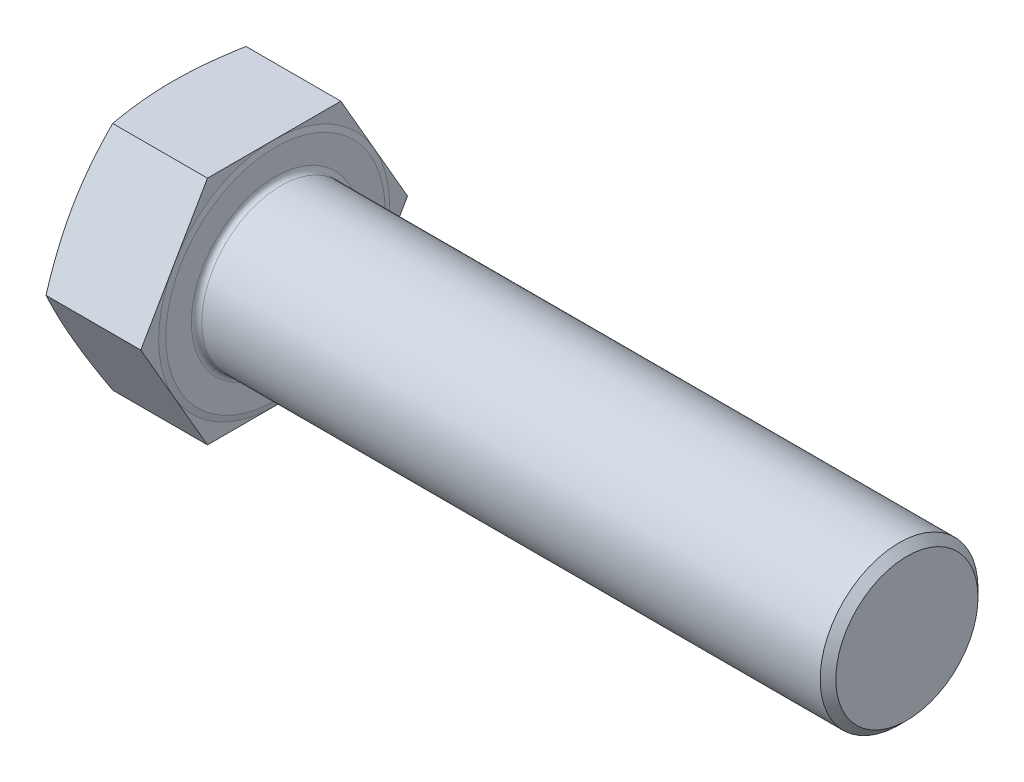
ISO-10303-21;
HEADER;
FILE_DESCRIPTION(('STEP AP214'),'2;1');
FILE_NAME('part.step','',(''),(''),'','','');
FILE_SCHEMA(('AUTOMOTIVE_DESIGN { 1 0 10303 214 1 1 1 1 }'));
ENDSEC;
DATA;
#1=APPLICATION_CONTEXT('core data for automotive mechanical design processes');
#2=APPLICATION_PROTOCOL_DEFINITION('international standard','automotive_design',2000,#1);
#3=PRODUCT_CONTEXT('',#1,'mechanical');
#4=PRODUCT('Part','Part','',(#3));
#5=PRODUCT_RELATED_PRODUCT_CATEGORY('part','',(#4));
#6=PRODUCT_DEFINITION_FORMATION('','',#4);
#7=PRODUCT_DEFINITION_CONTEXT('part definition',#1,'design');
#8=PRODUCT_DEFINITION('design','',#6,#7);
#9=PRODUCT_DEFINITION_SHAPE('','',#8);
#10=(LENGTH_UNIT() NAMED_UNIT(*) SI_UNIT(.MILLI.,.METRE.));
#11=(NAMED_UNIT(*) PLANE_ANGLE_UNIT() SI_UNIT($,.RADIAN.));
#12=(NAMED_UNIT(*) SI_UNIT($,.STERADIAN.) SOLID_ANGLE_UNIT());
#13=UNCERTAINTY_MEASURE_WITH_UNIT(LENGTH_MEASURE(1.E-05),#10,'distance_accuracy_value','');
#14=(GEOMETRIC_REPRESENTATION_CONTEXT(3) GLOBAL_UNCERTAINTY_ASSIGNED_CONTEXT((#13)) GLOBAL_UNIT_ASSIGNED_CONTEXT((#10,
#11,#12)) REPRESENTATION_CONTEXT('',''));
#15=CARTESIAN_POINT('',(0.,0.,0.));
#16=DIRECTION('',(0.,0.,1.));
#17=DIRECTION('',(1.,0.,0.));
#18=AXIS2_PLACEMENT_3D('',#15,#16,#17);
#19=CARTESIAN_POINT('',(39.,0.,0.));
#20=DIRECTION('',(1.,0.,0.));
#21=DIRECTION('',(0.,0.,-1.));
#22=AXIS2_PLACEMENT_3D('',#19,#20,#21);
#23=PLANE('',#22);
#24=CARTESIAN_POINT('',(39.,0.,0.));
#25=DIRECTION('',(1.,0.,0.));
#26=DIRECTION('',(0.,0.,-1.));
#27=AXIS2_PLACEMENT_3D('',#24,#25,#26);
#28=CIRCLE('',#27,32.);
#29=CARTESIAN_POINT('',(39.,0.,-32.));
#30=VERTEX_POINT('',#29);
#31=EDGE_CURVE('E188',#30,#30,#28,.F.);
#32=ORIENTED_EDGE('',*,*,#31,.T.);
#33=EDGE_LOOP('',(#32));
#34=FACE_BOUND('',#33,.T.);
#35=CARTESIAN_POINT('',(39.,0.,0.));
#36=DIRECTION('',(-1.,0.,0.));
#37=DIRECTION('',(0.,0.,1.));
#38=AXIS2_PLACEMENT_3D('',#35,#36,#37);
#39=CIRCLE('',#38,41.705);
#40=CARTESIAN_POINT('',(39.,0.,41.705));
#41=VERTEX_POINT('',#40);
#42=EDGE_CURVE('E138',#41,#41,#39,.T.);
#43=ORIENTED_EDGE('',*,*,#42,.F.);
#44=EDGE_LOOP('',(#43));
#45=FACE_BOUND('',#44,.T.);
#46=ADVANCED_FACE('F33',(#34,#45),#23,.T.);
#47=CARTESIAN_POINT('',(38.5,-87.8,0.));
#48=DIRECTION('',(-1.,0.,0.));
#49=DIRECTION('',(0.,0.,1.));
#50=AXIS2_PLACEMENT_3D('',#47,#48,#49);
#51=PLANE('',#50);
#52=DIRECTION('',(0.,-0.866025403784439,0.5));
#53=VECTOR('',#52,1.);
#54=CARTESIAN_POINT('',(38.5,43.9,25.3456768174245));
#55=LINE('',#54,#53);
#56=CARTESIAN_POINT('',(38.5,43.9,25.3456768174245));
#57=VERTEX_POINT('',#56);
#58=CARTESIAN_POINT('',(38.5,21.95,38.0185152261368));
#59=VERTEX_POINT('',#58);
#60=EDGE_CURVE('E137',#57,#59,#55,.T.);
#61=ORIENTED_EDGE('',*,*,#60,.T.);
#62=CARTESIAN_POINT('',(38.5,0.,0.));
#63=DIRECTION('',(-1.,0.,0.));
#64=DIRECTION('',(0.,0.,1.));
#65=AXIS2_PLACEMENT_3D('',#62,#63,#64);
#66=CIRCLE('',#65,43.9);
#67=CARTESIAN_POINT('',(38.5,43.9,0.));
#68=VERTEX_POINT('',#67);
#69=EDGE_CURVE('E49',#59,#68,#66,.T.);
#70=ORIENTED_EDGE('',*,*,#69,.T.);
#71=DIRECTION('',(0.,0.,1.));
#72=VECTOR('',#71,1.);
#73=CARTESIAN_POINT('',(38.5,43.9,-25.3456768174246));
#74=LINE('',#73,#72);
#75=EDGE_CURVE('E134',#68,#57,#74,.T.);
#76=ORIENTED_EDGE('',*,*,#75,.T.);
#77=EDGE_LOOP('',(#61,#70,#76));
#78=FACE_BOUND('',#77,.T.);
#79=ADVANCED_FACE('F133',(#78),#51,.F.);
#80=CARTESIAN_POINT('',(38.5,43.9,-25.3456768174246));
#81=VERTEX_POINT('',#80);
#82=EDGE_CURVE('E145',#81,#68,#74,.T.);
#83=ORIENTED_EDGE('',*,*,#82,.T.);
#84=CARTESIAN_POINT('',(38.5,21.95,-38.0185152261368));
#85=VERTEX_POINT('',#84);
#86=EDGE_CURVE('E121',#68,#85,#66,.T.);
#87=ORIENTED_EDGE('',*,*,#86,.T.);
#88=DIRECTION('',(0.,0.866025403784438,0.5));
#89=VECTOR('',#88,1.);
#90=CARTESIAN_POINT('',(38.5,0.,-50.6913536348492));
#91=LINE('',#90,#89);
#92=EDGE_CURVE('E151',#85,#81,#91,.T.);
#93=ORIENTED_EDGE('',*,*,#92,.T.);
#94=EDGE_LOOP('',(#83,#87,#93));
#95=FACE_BOUND('',#94,.T.);
#96=ADVANCED_FACE('F150',(#95),#51,.F.);
#97=CARTESIAN_POINT('',(38.5,0.,-50.6913536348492));
#98=VERTEX_POINT('',#97);
#99=EDGE_CURVE('E148',#98,#85,#91,.T.);
#100=ORIENTED_EDGE('',*,*,#99,.T.);
#101=CARTESIAN_POINT('',(38.5,-21.95,-38.0185152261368));
#102=VERTEX_POINT('',#101);
#103=EDGE_CURVE('E124',#85,#102,#66,.T.);
#104=ORIENTED_EDGE('',*,*,#103,.T.);
#105=DIRECTION('',(0.,0.866025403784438,-0.5));
#106=VECTOR('',#105,1.);
#107=CARTESIAN_POINT('',(38.5,-43.9,-25.3456768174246));
#108=LINE('',#107,#106);
#109=EDGE_CURVE('E348',#102,#98,#108,.T.);
#110=ORIENTED_EDGE('',*,*,#109,.T.);
#111=EDGE_LOOP('',(#100,#104,#110));
#112=FACE_BOUND('',#111,.T.);
#113=ADVANCED_FACE('F302',(#112),#51,.F.);
#114=CARTESIAN_POINT('',(38.5,-43.9,-25.3456768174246));
#115=VERTEX_POINT('',#114);
#116=EDGE_CURVE('E316',#115,#102,#108,.T.);
#117=ORIENTED_EDGE('',*,*,#116,.T.);
#118=CARTESIAN_POINT('',(38.5,-43.9,0.));
#119=VERTEX_POINT('',#118);
#120=EDGE_CURVE('E317',#102,#119,#66,.T.);
#121=ORIENTED_EDGE('',*,*,#120,.T.);
#122=DIRECTION('',(0.,0.,-1.));
#123=VECTOR('',#122,1.);
#124=CARTESIAN_POINT('',(38.5,-43.9,25.3456768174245));
#125=LINE('',#124,#123);
#126=EDGE_CURVE('E162',#119,#115,#125,.T.);
#127=ORIENTED_EDGE('',*,*,#126,.T.);
#128=EDGE_LOOP('',(#117,#121,#127));
#129=FACE_BOUND('',#128,.T.);
#130=ADVANCED_FACE('F295',(#129),#51,.F.);
#131=CARTESIAN_POINT('',(38.5,-43.9,25.3456768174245));
#132=VERTEX_POINT('',#131);
#133=EDGE_CURVE('E163',#132,#119,#125,.T.);
#134=ORIENTED_EDGE('',*,*,#133,.T.);
#135=CARTESIAN_POINT('',(38.5,-21.95,38.0185152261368));
#136=VERTEX_POINT('',#135);
#137=EDGE_CURVE('E306',#119,#136,#66,.T.);
#138=ORIENTED_EDGE('',*,*,#137,.T.);
#139=DIRECTION('',(0.,-0.866025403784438,-0.5));
#140=VECTOR('',#139,1.);
#141=CARTESIAN_POINT('',(38.5,0.,50.6913536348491));
#142=LINE('',#141,#140);
#143=EDGE_CURVE('E158',#136,#132,#142,.T.);
#144=ORIENTED_EDGE('',*,*,#143,.T.);
#145=EDGE_LOOP('',(#134,#138,#144));
#146=FACE_BOUND('',#145,.T.);
#147=ADVANCED_FACE('F287',(#146),#51,.F.);
#148=CARTESIAN_POINT('',(38.5,-43.9,-25.3456768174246));
#149=DIRECTION('',(0.,0.5,0.866025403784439));
#150=DIRECTION('',(0.,-0.866025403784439,0.5));
#151=AXIS2_PLACEMENT_3D('',#148,#149,#150);
#152=PLANE('',#151);
#153=CARTESIAN_POINT('',(2.47189260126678,0.000200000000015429,-50.691469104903));
#154=CARTESIAN_POINT('',(2.28086038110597,-0.908899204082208,-50.1666004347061));
#155=CARTESIAN_POINT('',(2.09842513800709,-1.81938541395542,-49.6409309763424));
#156=CARTESIAN_POINT('',(1.75262675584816,-3.64315407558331,-48.5879776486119));
#157=CARTESIAN_POINT('',(1.5892654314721,-4.55643678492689,-48.0606936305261));
#158=CARTESIAN_POINT('',(1.28341338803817,-6.3863459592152,-47.0041950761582));
#159=CARTESIAN_POINT('',(1.14093869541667,-7.3029744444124,-46.4749793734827));
#160=CARTESIAN_POINT('',(0.87889979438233,-9.13866887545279,-45.4151406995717));
#161=CARTESIAN_POINT('',(0.7593349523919,-10.0577347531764,-44.8845177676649));
#162=CARTESIAN_POINT('',(0.545887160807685,-11.8893570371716,-43.8270301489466));
#163=CARTESIAN_POINT('',(0.451772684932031,-12.8018931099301,-43.3001772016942));
#164=CARTESIAN_POINT('',(0.289247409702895,-14.6286944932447,-42.2454729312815));
#165=CARTESIAN_POINT('',(0.220836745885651,-15.5429598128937,-41.7176216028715));
#166=CARTESIAN_POINT('',(0.110909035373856,-17.3723740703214,-40.6614087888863));
#167=CARTESIAN_POINT('',(0.0693821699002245,-18.2875225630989,-40.1330475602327));
#168=CARTESIAN_POINT('',(0.0139276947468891,-20.1184473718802,-39.0759626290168));
#169=CARTESIAN_POINT('',(0.,-21.0342236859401,-38.5472389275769));
#170=CARTESIAN_POINT('',(0.,-22.8657763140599,-37.4897915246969));
#171=CARTESIAN_POINT('',(0.0139276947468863,-23.7815526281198,-36.961067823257));
#172=CARTESIAN_POINT('',(0.0693821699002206,-25.612477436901,-35.9039828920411));
#173=CARTESIAN_POINT('',(0.110909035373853,-26.5276259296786,-35.3756216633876));
#174=CARTESIAN_POINT('',(0.220836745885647,-28.3570401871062,-34.3194088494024));
#175=CARTESIAN_POINT('',(0.28924740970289,-29.2713055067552,-33.7915575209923));
#176=CARTESIAN_POINT('',(0.451772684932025,-31.0981068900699,-32.7368532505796));
#177=CARTESIAN_POINT('',(0.545887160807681,-32.0106429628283,-32.2100003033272));
#178=CARTESIAN_POINT('',(0.759334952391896,-33.8422652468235,-31.1525126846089));
#179=CARTESIAN_POINT('',(0.878899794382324,-34.7613311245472,-30.6218897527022));
#180=CARTESIAN_POINT('',(1.14093869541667,-36.5970255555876,-29.5620510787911));
#181=CARTESIAN_POINT('',(1.28341338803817,-37.5136540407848,-29.0328353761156));
#182=CARTESIAN_POINT('',(1.58926543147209,-39.3435632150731,-27.9763368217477));
#183=CARTESIAN_POINT('',(1.75262675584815,-40.2568459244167,-27.4490528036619));
#184=CARTESIAN_POINT('',(2.09842513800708,-42.0806145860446,-26.3960994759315));
#185=CARTESIAN_POINT('',(2.28086038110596,-42.9911007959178,-25.8704300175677));
#186=CARTESIAN_POINT('',(2.47189260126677,-43.9002,-25.3455613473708));
#187=B_SPLINE_CURVE_WITH_KNOTS('',3,(#153,#154,#155,#156,#157,#158,#159,#160,#161,#162,#163,
#164,#165,#166,#167,#168,#169,#170,#171,#172,#173,#174,#175,#176,#177,#178,#179,#180,#181,#182,
#183,#184,#185,#186),.UNSPECIFIED.,.F.,.F.,(4,2,2,2,2,2,2,2,2,2,2,2,2,2,2,2,4),(0.,
3.20095212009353,6.40220852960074,9.60590856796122,12.8095199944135,15.9829243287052,
19.1563453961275,22.328606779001,25.5008583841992,28.6731099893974,31.8453713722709,
35.0187924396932,38.1921967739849,41.3958082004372,44.5995082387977,47.8007646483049,
51.0017167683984),.UNSPECIFIED.);
#188=CARTESIAN_POINT('',(2.47185057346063,0.,-50.6913536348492));
#189=VERTEX_POINT('',#188);
#190=CARTESIAN_POINT('',(0.,-21.95,-38.0185152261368));
#191=VERTEX_POINT('',#190);
#192=EDGE_CURVE('E332',#189,#191,#187,.T.);
#193=ORIENTED_EDGE('',*,*,#192,.F.);
#194=DIRECTION('',(-1.,0.,0.));
#195=VECTOR('',#194,1.);
#196=CARTESIAN_POINT('',(38.5,0.,-50.6913536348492));
#197=LINE('',#196,#195);
#198=EDGE_CURVE('E178',#98,#189,#197,.T.);
#199=ORIENTED_EDGE('',*,*,#198,.F.);
#200=ORIENTED_EDGE('',*,*,#109,.F.);
#201=ORIENTED_EDGE('',*,*,#116,.F.);
#202=DIRECTION('',(-1.,0.,0.));
#203=VECTOR('',#202,1.);
#204=CARTESIAN_POINT('',(38.5,-43.9,-25.3456768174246));
#205=LINE('',#204,#203);
#206=CARTESIAN_POINT('',(2.47185057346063,-43.9,-25.3456768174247));
#207=VERTEX_POINT('',#206);
#208=EDGE_CURVE('E166',#115,#207,#205,.T.);
#209=ORIENTED_EDGE('',*,*,#208,.T.);
#210=EDGE_CURVE('E245',#191,#207,#187,.T.);
#211=ORIENTED_EDGE('',*,*,#210,.F.);
#212=EDGE_LOOP('',(#193,#199,#200,#201,#209,#211));
#213=FACE_BOUND('',#212,.T.);
#214=ADVANCED_FACE('F35',(#213),#152,.F.);
#215=CARTESIAN_POINT('',(38.5,0.,-50.6913536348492));
#216=DIRECTION('',(0.,-0.5,0.866025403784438));
#217=DIRECTION('',(0.,-0.866025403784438,-0.5));
#218=AXIS2_PLACEMENT_3D('',#215,#216,#217);
#219=PLANE('',#218);
#220=CARTESIAN_POINT('',(2.47189260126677,43.9002,-25.3455613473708));
#221=CARTESIAN_POINT('',(2.28086038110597,42.9911007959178,-25.8704300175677));
#222=CARTESIAN_POINT('',(2.09842513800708,42.0806145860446,-26.3960994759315));
#223=CARTESIAN_POINT('',(1.75262675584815,40.2568459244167,-27.4490528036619));
#224=CARTESIAN_POINT('',(1.58926543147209,39.3435632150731,-27.9763368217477));
#225=CARTESIAN_POINT('',(1.28341338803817,37.5136540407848,-29.0328353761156));
#226=CARTESIAN_POINT('',(1.14093869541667,36.5970255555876,-29.5620510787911));
#227=CARTESIAN_POINT('',(0.878899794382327,34.7613311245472,-30.6218897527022));
#228=CARTESIAN_POINT('',(0.7593349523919,33.8422652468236,-31.1525126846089));
#229=CARTESIAN_POINT('',(0.545887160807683,32.0106429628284,-32.2100003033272));
#230=CARTESIAN_POINT('',(0.451772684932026,31.0981068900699,-32.7368532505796));
#231=CARTESIAN_POINT('',(0.289247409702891,29.2713055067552,-33.7915575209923));
#232=CARTESIAN_POINT('',(0.22083674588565,28.3570401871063,-34.3194088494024));
#233=CARTESIAN_POINT('',(0.110909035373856,26.5276259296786,-35.3756216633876));
#234=CARTESIAN_POINT('',(0.0693821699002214,25.6124774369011,-35.9039828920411));
#235=CARTESIAN_POINT('',(0.0139276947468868,23.7815526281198,-36.961067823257));
#236=CARTESIAN_POINT('',(0.,22.8657763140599,-37.4897915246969));
#237=CARTESIAN_POINT('',(0.,21.0342236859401,-38.5472389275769));
#238=CARTESIAN_POINT('',(0.0139276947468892,20.1184473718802,-39.0759626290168));
#239=CARTESIAN_POINT('',(0.0693821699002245,18.2875225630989,-40.1330475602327));
#240=CARTESIAN_POINT('',(0.110909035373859,17.3723740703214,-40.6614087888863));
#241=CARTESIAN_POINT('',(0.220836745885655,15.5429598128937,-41.7176216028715));
#242=CARTESIAN_POINT('',(0.289247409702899,14.6286944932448,-42.2454729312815));
#243=CARTESIAN_POINT('',(0.451772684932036,12.8018931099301,-43.3001772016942));
#244=CARTESIAN_POINT('',(0.545887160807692,11.8893570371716,-43.8270301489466));
#245=CARTESIAN_POINT('',(0.759334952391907,10.0577347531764,-44.8845177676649));
#246=CARTESIAN_POINT('',(0.878899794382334,9.1386688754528,-45.4151406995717));
#247=CARTESIAN_POINT('',(1.14093869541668,7.30297444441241,-46.4749793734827));
#248=CARTESIAN_POINT('',(1.28341338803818,6.38634595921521,-47.0041950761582));
#249=CARTESIAN_POINT('',(1.5892654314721,4.5564367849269,-48.0606936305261));
#250=CARTESIAN_POINT('',(1.75262675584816,3.64315407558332,-48.5879776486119));
#251=CARTESIAN_POINT('',(2.09842513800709,1.81938541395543,-49.6409309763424));
#252=CARTESIAN_POINT('',(2.28086038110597,0.908899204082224,-50.1666004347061));
#253=CARTESIAN_POINT('',(2.47189260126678,-0.000199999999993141,-50.691469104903));
#254=B_SPLINE_CURVE_WITH_KNOTS('',3,(#220,#221,#222,#223,#224,#225,#226,#227,#228,#229,#230,
#231,#232,#233,#234,#235,#236,#237,#238,#239,#240,#241,#242,#243,#244,#245,#246,#247,#248,#249,
#250,#251,#252,#253),.UNSPECIFIED.,.F.,.F.,(4,2,2,2,2,2,2,2,2,2,2,2,2,2,2,2,4),(0.,
3.20095212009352,6.40220852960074,9.60590856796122,12.8095199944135,15.9829243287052,
19.1563453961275,22.328606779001,25.5008583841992,28.6731099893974,31.8453713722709,
35.0187924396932,38.1921967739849,41.3958082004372,44.5995082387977,47.8007646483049,
51.0017167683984),.UNSPECIFIED.);
#255=CARTESIAN_POINT('',(2.47185057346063,43.9,-25.3456768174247));
#256=VERTEX_POINT('',#255);
#257=CARTESIAN_POINT('',(0.,21.95,-38.0185152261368));
#258=VERTEX_POINT('',#257);
#259=EDGE_CURVE('E260',#256,#258,#254,.T.);
#260=ORIENTED_EDGE('',*,*,#259,.F.);
#261=DIRECTION('',(-1.,0.,0.));
#262=VECTOR('',#261,1.);
#263=CARTESIAN_POINT('',(38.5,43.9,-25.3456768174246));
#264=LINE('',#263,#262);
#265=EDGE_CURVE('E176',#81,#256,#264,.T.);
#266=ORIENTED_EDGE('',*,*,#265,.F.);
#267=ORIENTED_EDGE('',*,*,#92,.F.);
#268=ORIENTED_EDGE('',*,*,#99,.F.);
#269=ORIENTED_EDGE('',*,*,#198,.T.);
#270=EDGE_CURVE('E256',#258,#189,#254,.T.);
#271=ORIENTED_EDGE('',*,*,#270,.F.);
#272=EDGE_LOOP('',(#260,#266,#267,#268,#269,#271));
#273=FACE_BOUND('',#272,.T.);
#274=ADVANCED_FACE('F266',(#273),#219,.F.);
#275=CARTESIAN_POINT('',(38.5,43.9,-25.3456768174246));
#276=DIRECTION('',(0.,-1.,0.));
#277=DIRECTION('',(0.,0.,-1.));
#278=AXIS2_PLACEMENT_3D('',#275,#276,#277);
#279=PLANE('',#278);
#280=CARTESIAN_POINT('',(13.2085891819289,43.9,-67.1064400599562));
#281=CARTESIAN_POINT('',(12.9061204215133,43.9,-66.1133577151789));
#282=CARTESIAN_POINT('',(12.605476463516,43.9,-65.1197178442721));
#283=CARTESIAN_POINT('',(12.0082564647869,43.9,-63.1312103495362));
#284=CARTESIAN_POINT('',(11.7116804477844,43.9,-62.1363427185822));
#285=CARTESIAN_POINT('',(11.1229952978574,43.9,-60.1452011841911));
#286=CARTESIAN_POINT('',(10.8308865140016,43.9,-59.148927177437));
#287=CARTESIAN_POINT('',(10.2516551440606,43.9,-57.1549333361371));
#288=CARTESIAN_POINT('',(9.9645325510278,43.9,-56.157213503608));
#289=CARTESIAN_POINT('',(9.11038311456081,43.9,-53.1579628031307));
#290=CARTESIAN_POINT('',(8.55167549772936,43.9,-51.1540500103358));
#291=CARTESIAN_POINT('',(7.46174440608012,43.9,-47.1387775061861));
#292=CARTESIAN_POINT('',(6.93052043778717,43.9,-45.1274179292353));
#293=CARTESIAN_POINT('',(5.90872422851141,43.9,-41.1207563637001));
#294=CARTESIAN_POINT('',(5.41773152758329,43.9,-39.1255621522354));
#295=CARTESIAN_POINT('',(4.47754707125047,43.9,-35.1252473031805));
#296=CARTESIAN_POINT('',(4.0283560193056,43.9,-33.1201264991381));
#297=CARTESIAN_POINT('',(3.18224968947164,43.9,-29.0995025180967));
#298=CARTESIAN_POINT('',(2.78531657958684,43.9,-27.084003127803));
#299=CARTESIAN_POINT('',(2.0558084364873,43.9,-23.041322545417));
#300=CARTESIAN_POINT('',(1.72323124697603,43.9,-21.0141417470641));
#301=CARTESIAN_POINT('',(1.16888960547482,43.9,-17.1762786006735));
#302=CARTESIAN_POINT('',(0.938881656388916,43.9,-15.3668056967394));
#303=CARTESIAN_POINT('',(0.64683760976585,43.9,-12.6469554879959));
#304=CARTESIAN_POINT('',(0.558316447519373,43.9,-11.7393820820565));
#305=CARTESIAN_POINT('',(0.399926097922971,43.9,-9.92261755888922));
#306=CARTESIAN_POINT('',(0.330056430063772,43.9,-9.01342648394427));
#307=CARTESIAN_POINT('',(0.209872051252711,43.9,-7.19437696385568));
#308=CARTESIAN_POINT('',(0.159543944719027,43.9,-6.28451940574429));
#309=CARTESIAN_POINT('',(0.0790246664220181,43.9,-4.46391001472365));
#310=CARTESIAN_POINT('',(0.0488334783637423,43.9,-3.55315818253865));
#311=CARTESIAN_POINT('',(0.00899399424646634,43.9,-1.73120684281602));
#312=CARTESIAN_POINT('',(-0.00065437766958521,43.9,-0.820007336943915));
#313=CARTESIAN_POINT('',(0.000723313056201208,43.9,1.00237618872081));
#314=CARTESIAN_POINT('',(0.0117493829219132,43.9,1.91356020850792));
#315=CARTESIAN_POINT('',(0.0544334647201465,43.9,3.74006394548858));
#316=CARTESIAN_POINT('',(0.0861957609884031,43.9,4.65538121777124));
#317=CARTESIAN_POINT('',(0.170022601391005,43.9,6.48508119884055));
#318=CARTESIAN_POINT('',(0.222087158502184,43.9,7.39946390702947));
#319=CARTESIAN_POINT('',(0.345842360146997,43.9,9.22691143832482));
#320=CARTESIAN_POINT('',(0.417533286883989,43.9,10.1399762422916));
#321=CARTESIAN_POINT('',(0.57965039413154,43.9,11.964422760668));
#322=CARTESIAN_POINT('',(0.670076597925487,43.9,12.8758044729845));
#323=CARTESIAN_POINT('',(0.968095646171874,43.9,15.6085837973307));
#324=CARTESIAN_POINT('',(1.20232585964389,43.9,17.4271394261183));
#325=CARTESIAN_POINT('',(1.59985376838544,43.9,20.1480163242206));
#326=CARTESIAN_POINT('',(1.74006283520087,43.9,21.053830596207));
#327=CARTESIAN_POINT('',(2.03466720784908,43.9,22.8631638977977));
#328=CARTESIAN_POINT('',(2.18906261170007,43.9,23.766682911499));
#329=CARTESIAN_POINT('',(2.68874951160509,43.9,26.5691745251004));
#330=CARTESIAN_POINT('',(3.05635262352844,43.9,28.4641852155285));
#331=CARTESIAN_POINT('',(3.83886276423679,43.9,32.2444410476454));
#332=CARTESIAN_POINT('',(4.25377335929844,43.9,34.1296854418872));
#333=CARTESIAN_POINT('',(5.12219625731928,43.9,37.8917956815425));
#334=CARTESIAN_POINT('',(5.57571977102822,43.9,39.7686589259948));
#335=CARTESIAN_POINT('',(6.51398832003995,43.9,43.5144765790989));
#336=CARTESIAN_POINT('',(6.99873260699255,43.9,45.3834311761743));
#337=CARTESIAN_POINT('',(7.99424628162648,43.9,49.1169431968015));
#338=CARTESIAN_POINT('',(8.50504829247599,43.9,50.9814918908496));
#339=CARTESIAN_POINT('',(9.5474311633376,43.9,54.7047638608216));
#340=CARTESIAN_POINT('',(10.0790121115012,43.9,56.5634871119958));
#341=CARTESIAN_POINT('',(11.1591496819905,43.9,60.2756456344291));
#342=CARTESIAN_POINT('',(11.7077034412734,43.9,62.1290817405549));
#343=CARTESIAN_POINT('',(12.8189225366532,43.9,65.8317073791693));
#344=CARTESIAN_POINT('',(13.3815878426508,43.9,67.6808969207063));
#345=CARTESIAN_POINT('',(14.5124024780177,43.9,71.3552554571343));
#346=CARTESIAN_POINT('',(15.0804226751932,43.9,73.1804642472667));
#347=CARTESIAN_POINT('',(16.2261388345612,43.9,76.8278395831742));
#348=CARTESIAN_POINT('',(16.803834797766,43.9,78.6500061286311));
#349=CARTESIAN_POINT('',(17.9674493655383,43.9,82.2918017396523));
#350=CARTESIAN_POINT('',(18.5533683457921,43.9,84.1114306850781));
#351=CARTESIAN_POINT('',(19.7321977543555,43.9,87.7484228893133));
#352=CARTESIAN_POINT('',(20.3251081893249,43.9,89.5657861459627));
#353=CARTESIAN_POINT('',(21.5146679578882,43.9,93.1916479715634));
#354=CARTESIAN_POINT('',(22.1112945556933,43.9,95.0001540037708));
#355=CARTESIAN_POINT('',(23.3096961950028,43.9,98.6154598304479));
#356=CARTESIAN_POINT('',(23.9114712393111,43.9,100.422259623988));
#357=CARTESIAN_POINT('',(25.1194417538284,43.9,104.03421577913));
#358=CARTESIAN_POINT('',(25.7256368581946,43.9,105.839372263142));
#359=CARTESIAN_POINT('',(26.941949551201,43.9,109.448358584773));
#360=CARTESIAN_POINT('',(27.5520671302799,43.9,111.252188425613));
#361=CARTESIAN_POINT('',(28.1638741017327,43.9,113.05544370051));
#362=B_SPLINE_CURVE_WITH_KNOTS('',3,(#280,#281,#282,#283,#284,#285,#286,#287,#288,#289,#290,
#291,#292,#293,#294,#295,#296,#297,#298,#299,#300,#301,#302,#303,#304,#305,#306,#307,#308,#309,
#310,#311,#312,#313,#314,#315,#316,#317,#318,#319,#320,#321,#322,#323,#324,#325,#326,#327,#328,
#329,#330,#331,#332,#333,#334,#335,#336,#337,#338,#339,#340,#341,#342,#343,#344,#345,#346,#347,
#348,#349,#350,#351,#352,#353,#354,#355,#356,#357,#358,#359,#360,#361),.UNSPECIFIED.,.F.,.F.,(4,
2,2,2,2,2,2,2,2,2,2,2,2,2,2,2,2,2,2,2,2,2,2,2,2,2,2,2,2,2,2,2,2,2,2,2,2,2,2,2,4),(0.,
3.11437035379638,6.22875886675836,9.3433895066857,12.458015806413,18.6988754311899,
24.9396229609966,31.103425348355,37.2673314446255,43.4291287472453,49.5907195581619,
55.0614786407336,57.7969575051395,60.5323658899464,63.2658958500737,65.9994235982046,
68.7329412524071,71.4664598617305,74.2138325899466,76.9612070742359,79.7086210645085,
82.4560384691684,87.955309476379,90.7050347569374,93.4547790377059,99.244963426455,
105.035584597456,110.82789276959,116.62006215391,122.419670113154,128.219302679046,
134.017962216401,139.816609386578,145.551236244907,151.285863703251,157.020754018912,
162.755649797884,168.468776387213,174.18190608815,179.89456817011,185.607216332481),.UNSPECIFIED.);
#363=CARTESIAN_POINT('',(2.47185057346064,43.9000000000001,25.3456768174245));
#364=VERTEX_POINT('',#363);
#365=CARTESIAN_POINT('',(0.,43.9,0.));
#366=VERTEX_POINT('',#365);
#367=EDGE_CURVE('E349',#364,#366,#362,.F.);
#368=ORIENTED_EDGE('',*,*,#367,.F.);
#369=DIRECTION('',(-1.,0.,0.));
#370=VECTOR('',#369,1.);
#371=CARTESIAN_POINT('',(38.5,43.9,25.3456768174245));
#372=LINE('',#371,#370);
#373=EDGE_CURVE('E147',#57,#364,#372,.T.);
#374=ORIENTED_EDGE('',*,*,#373,.F.);
#375=ORIENTED_EDGE('',*,*,#75,.F.);
#376=ORIENTED_EDGE('',*,*,#82,.F.);
#377=ORIENTED_EDGE('',*,*,#265,.T.);
#378=EDGE_CURVE('E261',#366,#256,#362,.F.);
#379=ORIENTED_EDGE('',*,*,#378,.F.);
#380=EDGE_LOOP('',(#368,#374,#375,#376,#377,#379));
#381=FACE_BOUND('',#380,.T.);
#382=ADVANCED_FACE('F143',(#381),#279,.F.);
#383=CARTESIAN_POINT('',(38.5,43.9,25.3456768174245));
#384=DIRECTION('',(0.,-0.5,-0.866025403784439));
#385=DIRECTION('',(0.,0.866025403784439,-0.5));
#386=AXIS2_PLACEMENT_3D('',#383,#384,#385);
#387=PLANE('',#386);
#388=CARTESIAN_POINT('',(2.47189260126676,-0.000200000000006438,50.6914691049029));
#389=CARTESIAN_POINT('',(2.28086038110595,0.908899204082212,50.166600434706));
#390=CARTESIAN_POINT('',(2.09842513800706,1.81938541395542,49.6409309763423));
#391=CARTESIAN_POINT('',(1.75262675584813,3.64315407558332,48.5879776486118));
#392=CARTESIAN_POINT('',(1.58926543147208,4.5564367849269,48.060693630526));
#393=CARTESIAN_POINT('',(1.28341338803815,6.38634595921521,47.0041950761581));
#394=CARTESIAN_POINT('',(1.14093869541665,7.30297444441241,46.4749793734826));
#395=CARTESIAN_POINT('',(0.87889979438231,9.1386688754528,45.4151406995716));
#396=CARTESIAN_POINT('',(0.759334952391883,10.0577347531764,44.8845177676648));
#397=CARTESIAN_POINT('',(0.545887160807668,11.8893570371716,43.8270301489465));
#398=CARTESIAN_POINT('',(0.451772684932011,12.8018931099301,43.3001772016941));
#399=CARTESIAN_POINT('',(0.289247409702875,14.6286944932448,42.2454729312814));
#400=CARTESIAN_POINT('',(0.220836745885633,15.5429598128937,41.7176216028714));
#401=CARTESIAN_POINT('',(0.110909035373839,17.3723740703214,40.6614087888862));
#402=CARTESIAN_POINT('',(0.0693821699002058,18.2875225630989,40.1330475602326));
#403=CARTESIAN_POINT('',(0.0139276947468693,20.1184473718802,39.0759626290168));
#404=CARTESIAN_POINT('',(0.,21.0342236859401,38.5472389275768));
#405=CARTESIAN_POINT('',(0.,22.8657763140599,37.4897915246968));
#406=CARTESIAN_POINT('',(0.0139276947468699,23.7815526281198,36.9610678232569));
#407=CARTESIAN_POINT('',(0.0693821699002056,25.6124774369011,35.9039828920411));
#408=CARTESIAN_POINT('',(0.110909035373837,26.5276259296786,35.3756216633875));
#409=CARTESIAN_POINT('',(0.220836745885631,28.3570401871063,34.3194088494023));
#410=CARTESIAN_POINT('',(0.289247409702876,29.2713055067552,33.7915575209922));
#411=CARTESIAN_POINT('',(0.451772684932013,31.0981068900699,32.7368532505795));
#412=CARTESIAN_POINT('',(0.545887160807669,32.0106429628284,32.2100003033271));
#413=CARTESIAN_POINT('',(0.759334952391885,33.8422652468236,31.1525126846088));
#414=CARTESIAN_POINT('',(0.878899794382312,34.7613311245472,30.6218897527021));
#415=CARTESIAN_POINT('',(1.14093869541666,36.5970255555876,29.562051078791));
#416=CARTESIAN_POINT('',(1.28341338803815,37.5136540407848,29.0328353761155));
#417=CARTESIAN_POINT('',(1.58926543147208,39.3435632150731,27.9763368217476));
#418=CARTESIAN_POINT('',(1.75262675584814,40.2568459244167,27.4490528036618));
#419=CARTESIAN_POINT('',(2.09842513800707,42.0806145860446,26.3960994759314));
#420=CARTESIAN_POINT('',(2.28086038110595,42.9911007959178,25.8704300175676));
#421=CARTESIAN_POINT('',(2.47189260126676,43.9002,25.3455613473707));
#422=B_SPLINE_CURVE_WITH_KNOTS('',3,(#388,#389,#390,#391,#392,#393,#394,#395,#396,#397,#398,
#399,#400,#401,#402,#403,#404,#405,#406,#407,#408,#409,#410,#411,#412,#413,#414,#415,#416,#417,
#418,#419,#420,#421),.UNSPECIFIED.,.F.,.F.,(4,2,2,2,2,2,2,2,2,2,2,2,2,2,2,2,4),(0.,
3.20095212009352,6.40220852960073,9.60590856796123,12.8095199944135,15.9829243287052,
19.1563453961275,22.328606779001,25.5008583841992,28.6731099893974,31.8453713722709,
35.0187924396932,38.1921967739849,41.3958082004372,44.5995082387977,47.8007646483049,
51.0017167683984),.UNSPECIFIED.);
#423=CARTESIAN_POINT('',(2.47185057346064,1.42247325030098E-13,50.6913536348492));
#424=VERTEX_POINT('',#423);
#425=CARTESIAN_POINT('',(0.,21.95,38.0185152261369));
#426=VERTEX_POINT('',#425);
#427=EDGE_CURVE('E250',#424,#426,#422,.T.);
#428=ORIENTED_EDGE('',*,*,#427,.F.);
#429=DIRECTION('',(-1.,0.,0.));
#430=VECTOR('',#429,1.);
#431=CARTESIAN_POINT('',(38.5,0.,50.6913536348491));
#432=LINE('',#431,#430);
#433=CARTESIAN_POINT('',(38.5,0.,50.6913536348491));
#434=VERTEX_POINT('',#433);
#435=EDGE_CURVE('E172',#434,#424,#432,.T.);
#436=ORIENTED_EDGE('',*,*,#435,.F.);
#437=EDGE_CURVE('E153',#59,#434,#55,.T.);
#438=ORIENTED_EDGE('',*,*,#437,.F.);
#439=ORIENTED_EDGE('',*,*,#60,.F.);
#440=ORIENTED_EDGE('',*,*,#373,.T.);
#441=EDGE_CURVE('E335',#426,#364,#422,.T.);
#442=ORIENTED_EDGE('',*,*,#441,.F.);
#443=EDGE_LOOP('',(#428,#436,#438,#439,#440,#442));
#444=FACE_BOUND('',#443,.T.);
#445=ADVANCED_FACE('F272',(#444),#387,.F.);
#446=CARTESIAN_POINT('',(38.5,0.,50.6913536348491));
#447=DIRECTION('',(0.,0.5,-0.866025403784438));
#448=DIRECTION('',(0.,0.866025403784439,0.5));
#449=AXIS2_PLACEMENT_3D('',#446,#447,#448);
#450=PLANE('',#449);
#451=CARTESIAN_POINT('',(2.47189260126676,-43.9002,25.3455613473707));
#452=CARTESIAN_POINT('',(2.28086038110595,-42.9911007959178,25.8704300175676));
#453=CARTESIAN_POINT('',(2.09842513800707,-42.0806145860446,26.3960994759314));
#454=CARTESIAN_POINT('',(1.75262675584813,-40.2568459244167,27.4490528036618));
#455=CARTESIAN_POINT('',(1.58926543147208,-39.3435632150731,27.9763368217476));
#456=CARTESIAN_POINT('',(1.28341338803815,-37.5136540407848,29.0328353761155));
#457=CARTESIAN_POINT('',(1.14093869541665,-36.5970255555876,29.562051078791));
#458=CARTESIAN_POINT('',(0.878899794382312,-34.7613311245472,30.6218897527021));
#459=CARTESIAN_POINT('',(0.759334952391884,-33.8422652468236,31.1525126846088));
#460=CARTESIAN_POINT('',(0.545887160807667,-32.0106429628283,32.2100003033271));
#461=CARTESIAN_POINT('',(0.451772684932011,-31.0981068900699,32.7368532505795));
#462=CARTESIAN_POINT('',(0.289247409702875,-29.2713055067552,33.7915575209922));
#463=CARTESIAN_POINT('',(0.220836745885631,-28.3570401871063,34.3194088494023));
#464=CARTESIAN_POINT('',(0.110909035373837,-26.5276259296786,35.3756216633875));
#465=CARTESIAN_POINT('',(0.0693821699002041,-25.612477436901,35.9039828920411));
#466=CARTESIAN_POINT('',(0.013927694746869,-23.7815526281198,36.9610678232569));
#467=CARTESIAN_POINT('',(0.,-22.8657763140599,37.4897915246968));
#468=CARTESIAN_POINT('',(0.,-21.0342236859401,38.5472389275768));
#469=CARTESIAN_POINT('',(0.013927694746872,-20.1184473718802,39.0759626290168));
#470=CARTESIAN_POINT('',(0.0693821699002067,-18.2875225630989,40.1330475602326));
#471=CARTESIAN_POINT('',(0.110909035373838,-17.3723740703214,40.6614087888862));
#472=CARTESIAN_POINT('',(0.220836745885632,-15.5429598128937,41.7176216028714));
#473=CARTESIAN_POINT('',(0.289247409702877,-14.6286944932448,42.2454729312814));
#474=CARTESIAN_POINT('',(0.451772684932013,-12.8018931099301,43.3001772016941));
#475=CARTESIAN_POINT('',(0.545887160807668,-11.8893570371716,43.8270301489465));
#476=CARTESIAN_POINT('',(0.759334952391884,-10.0577347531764,44.8845177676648));
#477=CARTESIAN_POINT('',(0.878899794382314,-9.13866887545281,45.4151406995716));
#478=CARTESIAN_POINT('',(1.14093869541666,-7.30297444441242,46.4749793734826));
#479=CARTESIAN_POINT('',(1.28341338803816,-6.38634595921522,47.0041950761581));
#480=CARTESIAN_POINT('',(1.58926543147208,-4.55643678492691,48.060693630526));
#481=CARTESIAN_POINT('',(1.75262675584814,-3.64315407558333,48.5879776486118));
#482=CARTESIAN_POINT('',(2.09842513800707,-1.81938541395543,49.6409309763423));
#483=CARTESIAN_POINT('',(2.28086038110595,-0.908899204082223,50.166600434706));
#484=CARTESIAN_POINT('',(2.47189260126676,0.000199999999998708,50.6914691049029));
#485=B_SPLINE_CURVE_WITH_KNOTS('',3,(#451,#452,#453,#454,#455,#456,#457,#458,#459,#460,#461,
#462,#463,#464,#465,#466,#467,#468,#469,#470,#471,#472,#473,#474,#475,#476,#477,#478,#479,#480,
#481,#482,#483,#484),.UNSPECIFIED.,.F.,.F.,(4,2,2,2,2,2,2,2,2,2,2,2,2,2,2,2,4),(0.,
3.20095212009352,6.40220852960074,9.60590856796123,12.8095199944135,15.9829243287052,
19.1563453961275,22.328606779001,25.5008583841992,28.6731099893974,31.8453713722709,
35.0187924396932,38.1921967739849,41.3958082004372,44.5995082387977,47.8007646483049,
51.0017167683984),.UNSPECIFIED.);
#486=CARTESIAN_POINT('',(2.47185057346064,-43.9,25.3456768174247));
#487=VERTEX_POINT('',#486);
#488=CARTESIAN_POINT('',(0.,-21.95,38.0185152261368));
#489=VERTEX_POINT('',#488);
#490=EDGE_CURVE('E238',#487,#489,#485,.T.);
#491=ORIENTED_EDGE('',*,*,#490,.F.);
#492=DIRECTION('',(-1.,0.,0.));
#493=VECTOR('',#492,1.);
#494=CARTESIAN_POINT('',(38.5,-43.9,25.3456768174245));
#495=LINE('',#494,#493);
#496=EDGE_CURVE('E169',#132,#487,#495,.T.);
#497=ORIENTED_EDGE('',*,*,#496,.F.);
#498=ORIENTED_EDGE('',*,*,#143,.F.);
#499=EDGE_CURVE('E159',#434,#136,#142,.T.);
#500=ORIENTED_EDGE('',*,*,#499,.F.);
#501=ORIENTED_EDGE('',*,*,#435,.T.);
#502=EDGE_CURVE('E330',#489,#424,#485,.T.);
#503=ORIENTED_EDGE('',*,*,#502,.F.);
#504=EDGE_LOOP('',(#491,#497,#498,#500,#501,#503));
#505=FACE_BOUND('',#504,.T.);
#506=ADVANCED_FACE('F275',(#505),#450,.F.);
#507=CARTESIAN_POINT('',(38.5,-43.9,25.3456768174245));
#508=DIRECTION('',(0.,1.,0.));
#509=DIRECTION('',(0.,0.,1.));
#510=AXIS2_PLACEMENT_3D('',#507,#508,#509);
#511=PLANE('',#510);
#512=CARTESIAN_POINT('',(13.2085891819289,-43.9,-67.1064400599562));
#513=CARTESIAN_POINT('',(12.9061204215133,-43.9,-66.1133577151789));
#514=CARTESIAN_POINT('',(12.6054764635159,-43.9,-65.1197178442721));
#515=CARTESIAN_POINT('',(12.0082564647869,-43.9,-63.1312103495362));
#516=CARTESIAN_POINT('',(11.7116804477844,-43.9,-62.1363427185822));
#517=CARTESIAN_POINT('',(11.1229952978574,-43.9,-60.1452011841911));
#518=CARTESIAN_POINT('',(10.8308865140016,-43.9,-59.148927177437));
#519=CARTESIAN_POINT('',(10.2516551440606,-43.9,-57.1549333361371));
#520=CARTESIAN_POINT('',(9.9645325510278,-43.9,-56.157213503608));
#521=CARTESIAN_POINT('',(9.11038311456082,-43.9,-53.1579628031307));
#522=CARTESIAN_POINT('',(8.55167549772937,-43.9,-51.1540500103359));
#523=CARTESIAN_POINT('',(7.46174440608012,-43.9,-47.1387775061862));
#524=CARTESIAN_POINT('',(6.93052043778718,-43.9,-45.1274179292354));
#525=CARTESIAN_POINT('',(5.90872422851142,-43.9,-41.1207563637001));
#526=CARTESIAN_POINT('',(5.4177315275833,-43.9,-39.1255621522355));
#527=CARTESIAN_POINT('',(4.47754707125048,-43.9,-35.1252473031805));
#528=CARTESIAN_POINT('',(4.02835601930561,-43.9,-33.1201264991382));
#529=CARTESIAN_POINT('',(3.18224968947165,-43.9,-29.0995025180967));
#530=CARTESIAN_POINT('',(2.78531657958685,-43.9,-27.084003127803));
#531=CARTESIAN_POINT('',(2.05580843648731,-43.9,-23.041322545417));
#532=CARTESIAN_POINT('',(1.72323124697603,-43.9,-21.0141417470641));
#533=CARTESIAN_POINT('',(1.16888960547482,-43.9,-17.1762786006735));
#534=CARTESIAN_POINT('',(0.938881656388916,-43.9,-15.3668056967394));
#535=CARTESIAN_POINT('',(0.64683760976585,-43.9,-12.646955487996));
#536=CARTESIAN_POINT('',(0.558316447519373,-43.9,-11.7393820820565));
#537=CARTESIAN_POINT('',(0.399926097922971,-43.9,-9.92261755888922));
#538=CARTESIAN_POINT('',(0.330056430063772,-43.9,-9.01342648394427));
#539=CARTESIAN_POINT('',(0.209872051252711,-43.9,-7.19437696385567));
#540=CARTESIAN_POINT('',(0.159543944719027,-43.9,-6.28451940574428));
#541=CARTESIAN_POINT('',(0.0790246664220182,-43.9,-4.46391001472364));
#542=CARTESIAN_POINT('',(0.0488334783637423,-43.9,-3.55315818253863));
#543=CARTESIAN_POINT('',(0.00899399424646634,-43.9,-1.731206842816));
#544=CARTESIAN_POINT('',(-0.000654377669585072,-43.9,-0.820007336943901));
#545=CARTESIAN_POINT('',(0.00072331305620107,-43.9,1.00237618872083));
#546=CARTESIAN_POINT('',(0.0117493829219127,-43.9,1.91356020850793));
#547=CARTESIAN_POINT('',(0.054433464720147,-43.9,3.74006394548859));
#548=CARTESIAN_POINT('',(0.0861957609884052,-43.9,4.65538121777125));
#549=CARTESIAN_POINT('',(0.170022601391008,-43.9,6.48508119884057));
#550=CARTESIAN_POINT('',(0.222087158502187,-43.9,7.39946390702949));
#551=CARTESIAN_POINT('',(0.345842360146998,-43.9,9.22691143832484));
#552=CARTESIAN_POINT('',(0.417533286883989,-43.9,10.1399762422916));
#553=CARTESIAN_POINT('',(0.57965039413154,-43.9,11.964422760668));
#554=CARTESIAN_POINT('',(0.670076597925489,-43.9,12.8758044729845));
#555=CARTESIAN_POINT('',(0.968095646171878,-43.9,15.6085837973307));
#556=CARTESIAN_POINT('',(1.20232585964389,-43.9,17.4271394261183));
#557=CARTESIAN_POINT('',(1.59985376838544,-43.9,20.1480163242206));
#558=CARTESIAN_POINT('',(1.74006283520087,-43.9,21.053830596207));
#559=CARTESIAN_POINT('',(2.03466720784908,-43.9,22.8631638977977));
#560=CARTESIAN_POINT('',(2.18906261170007,-43.9,23.766682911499));
#561=CARTESIAN_POINT('',(2.68874951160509,-43.9,26.5691745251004));
#562=CARTESIAN_POINT('',(3.05635262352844,-43.9,28.4641852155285));
#563=CARTESIAN_POINT('',(3.83886276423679,-43.9,32.2444410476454));
#564=CARTESIAN_POINT('',(4.25377335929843,-43.9,34.1296854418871));
#565=CARTESIAN_POINT('',(5.12219625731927,-43.9,37.8917956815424));
#566=CARTESIAN_POINT('',(5.57571977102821,-43.9,39.7686589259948));
#567=CARTESIAN_POINT('',(6.51398832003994,-43.9,43.5144765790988));
#568=CARTESIAN_POINT('',(6.99873260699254,-43.9,45.3834311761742));
#569=CARTESIAN_POINT('',(7.99424628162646,-43.9,49.1169431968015));
#570=CARTESIAN_POINT('',(8.50504829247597,-43.9,50.9814918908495));
#571=CARTESIAN_POINT('',(9.54743116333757,-43.9,54.7047638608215));
#572=CARTESIAN_POINT('',(10.0790121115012,-43.9,56.5634871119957));
#573=CARTESIAN_POINT('',(11.1591496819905,-43.9,60.275645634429));
#574=CARTESIAN_POINT('',(11.7077034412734,-43.9,62.1290817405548));
#575=CARTESIAN_POINT('',(12.8189225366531,-43.9,65.8317073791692));
#576=CARTESIAN_POINT('',(13.3815878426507,-43.9,67.6808969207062));
#577=CARTESIAN_POINT('',(14.5124024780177,-43.9,71.3552554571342));
#578=CARTESIAN_POINT('',(15.0804226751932,-43.9,73.1804642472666));
#579=CARTESIAN_POINT('',(16.2261388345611,-43.9,76.8278395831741));
#580=CARTESIAN_POINT('',(16.8038347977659,-43.9,78.650006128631));
#581=CARTESIAN_POINT('',(17.9674493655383,-43.9,82.2918017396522));
#582=CARTESIAN_POINT('',(18.5533683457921,-43.9,84.111430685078));
#583=CARTESIAN_POINT('',(19.7321977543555,-43.9,87.7484228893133));
#584=CARTESIAN_POINT('',(20.3251081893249,-43.9,89.5657861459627));
#585=CARTESIAN_POINT('',(21.5146679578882,-43.9,93.1916479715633));
#586=CARTESIAN_POINT('',(22.1112945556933,-43.9,95.0001540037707));
#587=CARTESIAN_POINT('',(23.3096961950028,-43.9,98.6154598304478));
#588=CARTESIAN_POINT('',(23.9114712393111,-43.9,100.422259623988));
#589=CARTESIAN_POINT('',(25.1194417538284,-43.9,104.03421577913));
#590=CARTESIAN_POINT('',(25.7256368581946,-43.9,105.839372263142));
#591=CARTESIAN_POINT('',(26.941949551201,-43.9,109.448358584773));
#592=CARTESIAN_POINT('',(27.5520671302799,-43.9,111.252188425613));
#593=CARTESIAN_POINT('',(28.1638741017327,-43.9,113.055443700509));
#594=B_SPLINE_CURVE_WITH_KNOTS('',3,(#512,#513,#514,#515,#516,#517,#518,#519,#520,#521,#522,
#523,#524,#525,#526,#527,#528,#529,#530,#531,#532,#533,#534,#535,#536,#537,#538,#539,#540,#541,
#542,#543,#544,#545,#546,#547,#548,#549,#550,#551,#552,#553,#554,#555,#556,#557,#558,#559,#560,
#561,#562,#563,#564,#565,#566,#567,#568,#569,#570,#571,#572,#573,#574,#575,#576,#577,#578,#579,
#580,#581,#582,#583,#584,#585,#586,#587,#588,#589,#590,#591,#592,#593),.UNSPECIFIED.,.F.,.F.,(4,
2,2,2,2,2,2,2,2,2,2,2,2,2,2,2,2,2,2,2,2,2,2,2,2,2,2,2,2,2,2,2,2,2,2,2,2,2,2,2,4),(0.,
3.11437035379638,6.22875886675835,9.34338950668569,12.458015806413,18.6988754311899,
24.9396229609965,31.103425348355,37.2673314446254,43.4291287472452,49.5907195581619,
55.0614786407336,57.7969575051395,60.5323658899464,63.2658958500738,65.9994235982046,
68.7329412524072,71.4664598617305,74.2138325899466,76.961207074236,79.7086210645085,
82.4560384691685,87.955309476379,90.7050347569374,93.454779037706,99.244963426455,
105.035584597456,110.82789276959,116.62006215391,122.419670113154,128.219302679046,
134.017962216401,139.816609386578,145.551236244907,151.28586370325,157.020754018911,
162.755649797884,168.468776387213,174.18190608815,179.89456817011,185.607216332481),.UNSPECIFIED.);
#595=CARTESIAN_POINT('',(0.,-43.9,0.));
#596=VERTEX_POINT('',#595);
#597=EDGE_CURVE('E323',#207,#596,#594,.T.);
#598=ORIENTED_EDGE('',*,*,#597,.F.);
#599=ORIENTED_EDGE('',*,*,#208,.F.);
#600=ORIENTED_EDGE('',*,*,#126,.F.);
#601=ORIENTED_EDGE('',*,*,#133,.F.);
#602=ORIENTED_EDGE('',*,*,#496,.T.);
#603=EDGE_CURVE('E228',#596,#487,#594,.T.);
#604=ORIENTED_EDGE('',*,*,#603,.F.);
#605=EDGE_LOOP('',(#598,#599,#600,#601,#602,#604));
#606=FACE_BOUND('',#605,.T.);
#607=ADVANCED_FACE('F279',(#606),#511,.F.);
#608=ORIENTED_EDGE('',*,*,#499,.T.);
#609=EDGE_CURVE('E139',#136,#59,#66,.T.);
#610=ORIENTED_EDGE('',*,*,#609,.T.);
#611=ORIENTED_EDGE('',*,*,#437,.T.);
#612=EDGE_LOOP('',(#608,#610,#611));
#613=FACE_BOUND('',#612,.T.);
#614=ADVANCED_FACE('F213',(#613),#51,.F.);
#615=CARTESIAN_POINT('',(0.,0.,0.));
#616=DIRECTION('',(1.,0.,0.));
#617=DIRECTION('',(0.,0.,-1.));
#618=AXIS2_PLACEMENT_3D('',#615,#616,#617);
#619=CONICAL_SURFACE('',#618,43.9,1.22173047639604);
#620=ORIENTED_EDGE('',*,*,#427,.T.);
#621=CARTESIAN_POINT('',(0.,0.,0.));
#622=DIRECTION('',(-1.,0.,0.));
#623=DIRECTION('',(0.,0.,1.));
#624=AXIS2_PLACEMENT_3D('',#621,#622,#623);
#625=CIRCLE('',#624,43.9);
#626=EDGE_CURVE('E181',#489,#426,#625,.T.);
#627=ORIENTED_EDGE('',*,*,#626,.F.);
#628=ORIENTED_EDGE('',*,*,#502,.T.);
#629=EDGE_LOOP('',(#620,#627,#628));
#630=FACE_BOUND('',#629,.T.);
#631=ADVANCED_FACE('F285',(#630),#619,.T.);
#632=ORIENTED_EDGE('',*,*,#490,.T.);
#633=EDGE_CURVE('E184',#596,#489,#625,.T.);
#634=ORIENTED_EDGE('',*,*,#633,.F.);
#635=ORIENTED_EDGE('',*,*,#603,.T.);
#636=EDGE_LOOP('',(#632,#634,#635));
#637=FACE_BOUND('',#636,.T.);
#638=ADVANCED_FACE('F224',(#637),#619,.T.);
#639=ORIENTED_EDGE('',*,*,#210,.T.);
#640=ORIENTED_EDGE('',*,*,#597,.T.);
#641=EDGE_CURVE('E344',#191,#596,#625,.T.);
#642=ORIENTED_EDGE('',*,*,#641,.F.);
#643=EDGE_LOOP('',(#639,#640,#642));
#644=FACE_BOUND('',#643,.T.);
#645=ADVANCED_FACE('F292',(#644),#619,.T.);
#646=ORIENTED_EDGE('',*,*,#270,.T.);
#647=ORIENTED_EDGE('',*,*,#192,.T.);
#648=EDGE_CURVE('E340',#258,#191,#625,.T.);
#649=ORIENTED_EDGE('',*,*,#648,.F.);
#650=EDGE_LOOP('',(#646,#647,#649));
#651=FACE_BOUND('',#650,.T.);
#652=ADVANCED_FACE('F293',(#651),#619,.T.);
#653=ORIENTED_EDGE('',*,*,#378,.T.);
#654=ORIENTED_EDGE('',*,*,#259,.T.);
#655=EDGE_CURVE('E185',#366,#258,#625,.T.);
#656=ORIENTED_EDGE('',*,*,#655,.F.);
#657=EDGE_LOOP('',(#653,#654,#656));
#658=FACE_BOUND('',#657,.T.);
#659=ADVANCED_FACE('F223',(#658),#619,.T.);
#660=ORIENTED_EDGE('',*,*,#367,.T.);
#661=CARTESIAN_POINT('',(0.,0.,0.));
#662=DIRECTION('',(-1.,0.,0.));
#663=DIRECTION('',(0.,0.,1.));
#664=AXIS2_PLACEMENT_3D('',#661,#662,#663);
#665=CIRCLE('',#664,43.9);
#666=EDGE_CURVE('E57',#426,#366,#665,.T.);
#667=ORIENTED_EDGE('',*,*,#666,.F.);
#668=ORIENTED_EDGE('',*,*,#441,.T.);
#669=EDGE_LOOP('',(#660,#667,#668));
#670=FACE_BOUND('',#669,.T.);
#671=ADVANCED_FACE('F218',(#670),#619,.T.);
#672=CARTESIAN_POINT('',(0.,-87.8,0.));
#673=DIRECTION('',(-1.,0.,0.));
#674=DIRECTION('',(0.,0.,1.));
#675=AXIS2_PLACEMENT_3D('',#672,#673,#674);
#676=PLANE('',#675);
#677=ORIENTED_EDGE('',*,*,#626,.T.);
#678=ORIENTED_EDGE('',*,*,#666,.T.);
#679=ORIENTED_EDGE('',*,*,#655,.T.);
#680=ORIENTED_EDGE('',*,*,#648,.T.);
#681=ORIENTED_EDGE('',*,*,#641,.T.);
#682=ORIENTED_EDGE('',*,*,#633,.T.);
#683=EDGE_LOOP('',(#677,#678,#679,#680,#681,#682));
#684=FACE_BOUND('',#683,.T.);
#685=ADVANCED_FACE('F222',(#684),#676,.T.);
#686=CARTESIAN_POINT('',(38.5,0.,0.));
#687=DIRECTION('',(-1.,0.,0.));
#688=DIRECTION('',(0.,0.,1.));
#689=AXIS2_PLACEMENT_3D('',#686,#687,#688);
#690=CONICAL_SURFACE('',#689,43.9,1.34682750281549);
#691=ORIENTED_EDGE('',*,*,#42,.T.);
#692=EDGE_LOOP('',(#691));
#693=FACE_BOUND('',#692,.T.);
#694=ORIENTED_EDGE('',*,*,#69,.F.);
#695=ORIENTED_EDGE('',*,*,#609,.F.);
#696=ORIENTED_EDGE('',*,*,#137,.F.);
#697=ORIENTED_EDGE('',*,*,#120,.F.);
#698=ORIENTED_EDGE('',*,*,#103,.F.);
#699=ORIENTED_EDGE('',*,*,#86,.F.);
#700=EDGE_LOOP('',(#694,#695,#696,#697,#698,#699));
#701=FACE_BOUND('',#700,.T.);
#702=ADVANCED_FACE('F122',(#693,#701),#690,.T.);
#703=CARTESIAN_POINT('',(279.,0.,0.));
#704=DIRECTION('',(-1.,0.,0.));
#705=DIRECTION('',(0.,0.,1.));
#706=AXIS2_PLACEMENT_3D('',#703,#704,#705);
#707=CYLINDRICAL_SURFACE('',#706,30.);
#708=CARTESIAN_POINT('',(276.023,0.,0.));
#709=DIRECTION('',(1.,0.,0.));
#710=DIRECTION('',(0.,0.,-1.));
#711=AXIS2_PLACEMENT_3D('',#708,#709,#710);
#712=CIRCLE('',#711,30.);
#713=CARTESIAN_POINT('',(276.023,0.,-30.));
#714=VERTEX_POINT('',#713);
#715=EDGE_CURVE('E12',#714,#714,#712,.F.);
#716=ORIENTED_EDGE('',*,*,#715,.T.);
#717=EDGE_LOOP('',(#716));
#718=FACE_BOUND('',#717,.T.);
#719=CARTESIAN_POINT('',(41.,0.,0.));
#720=DIRECTION('',(1.,0.,0.));
#721=DIRECTION('',(0.,0.,-1.));
#722=AXIS2_PLACEMENT_3D('',#719,#720,#721);
#723=CIRCLE('',#722,30.);
#724=CARTESIAN_POINT('',(41.,0.,-30.));
#725=VERTEX_POINT('',#724);
#726=EDGE_CURVE('E128',#725,#725,#723,.T.);
#727=ORIENTED_EDGE('',*,*,#726,.T.);
#728=EDGE_LOOP('',(#727));
#729=FACE_BOUND('',#728,.T.);
#730=ADVANCED_FACE('F387',(#718,#729),#707,.T.);
#731=CARTESIAN_POINT('',(279.,0.,0.));
#732=DIRECTION('',(1.,0.,0.));
#733=DIRECTION('',(0.,0.,-1.));
#734=AXIS2_PLACEMENT_3D('',#731,#732,#733);
#735=PLANE('',#734);
#736=CARTESIAN_POINT('',(279.,0.,0.));
#737=DIRECTION('',(1.,0.,0.));
#738=DIRECTION('',(0.,0.,-1.));
#739=AXIS2_PLACEMENT_3D('',#736,#737,#738);
#740=CIRCLE('',#739,27.0229999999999);
#741=CARTESIAN_POINT('',(279.,0.,-27.023));
#742=VERTEX_POINT('',#741);
#743=EDGE_CURVE('E42',#742,#742,#740,.T.);
#744=ORIENTED_EDGE('',*,*,#743,.T.);
#745=EDGE_LOOP('',(#744));
#746=FACE_BOUND('',#745,.T.);
#747=ADVANCED_FACE('F193',(#746),#735,.T.);
#748=CARTESIAN_POINT('',(41.,0.,0.));
#749=DIRECTION('',(1.,0.,0.));
#750=DIRECTION('',(0.,0.,-1.));
#751=AXIS2_PLACEMENT_3D('',#748,#749,#750);
#752=TOROIDAL_SURFACE('',#751,32.,2.);
#753=ORIENTED_EDGE('',*,*,#31,.F.);
#754=EDGE_LOOP('',(#753));
#755=FACE_BOUND('',#754,.T.);
#756=ORIENTED_EDGE('',*,*,#726,.F.);
#757=EDGE_LOOP('',(#756));
#758=FACE_BOUND('',#757,.T.);
#759=ADVANCED_FACE('F197',(#755,#758),#752,.F.);
#760=CARTESIAN_POINT('',(279.,0.,0.));
#761=DIRECTION('',(-1.,0.,0.));
#762=DIRECTION('',(0.,0.,1.));
#763=AXIS2_PLACEMENT_3D('',#760,#761,#762);
#764=CONICAL_SURFACE('',#763,27.0229999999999,0.78539816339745);
#765=ORIENTED_EDGE('',*,*,#715,.F.);
#766=EDGE_LOOP('',(#765));
#767=FACE_BOUND('',#766,.T.);
#768=ORIENTED_EDGE('',*,*,#743,.F.);
#769=EDGE_LOOP('',(#768));
#770=FACE_BOUND('',#769,.T.);
#771=ADVANCED_FACE('F195',(#767,#770),#764,.T.);
#772=CLOSED_SHELL('',(#46,#79,#96,#113,#130,#147,#214,#274,#382,#445,#506,#607,#614,#631,#638,
#645,#652,#659,#671,#685,#702,#730,#747,#759,#771));
#773=MANIFOLD_SOLID_BREP('B2',#772);
#774=ADVANCED_BREP_SHAPE_REPRESENTATION('',(#18,#773),#14);
#775=SHAPE_DEFINITION_REPRESENTATION(#9,#774);
ENDSEC;
END-ISO-10303-21;
